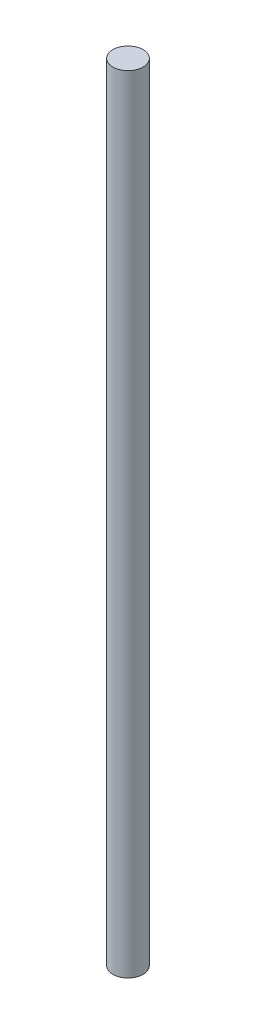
ISO-10303-21;
HEADER;
FILE_DESCRIPTION(('STEP AP214'),'2;1');
FILE_NAME('part.step','',(''),(''),'','','');
FILE_SCHEMA(('AUTOMOTIVE_DESIGN { 1 0 10303 214 1 1 1 1 }'));
ENDSEC;
DATA;
#1=APPLICATION_CONTEXT('core data for automotive mechanical design processes');
#2=APPLICATION_PROTOCOL_DEFINITION('international standard','automotive_design',2000,#1);
#3=PRODUCT_CONTEXT('',#1,'mechanical');
#4=PRODUCT('Part','Part','',(#3));
#5=PRODUCT_RELATED_PRODUCT_CATEGORY('part','',(#4));
#6=PRODUCT_DEFINITION_FORMATION('','',#4);
#7=PRODUCT_DEFINITION_CONTEXT('part definition',#1,'design');
#8=PRODUCT_DEFINITION('design','',#6,#7);
#9=PRODUCT_DEFINITION_SHAPE('','',#8);
#10=(LENGTH_UNIT() NAMED_UNIT(*) SI_UNIT(.MILLI.,.METRE.));
#11=(NAMED_UNIT(*) PLANE_ANGLE_UNIT() SI_UNIT($,.RADIAN.));
#12=(NAMED_UNIT(*) SI_UNIT($,.STERADIAN.) SOLID_ANGLE_UNIT());
#13=UNCERTAINTY_MEASURE_WITH_UNIT(LENGTH_MEASURE(1.E-05),#10,'distance_accuracy_value','');
#14=(GEOMETRIC_REPRESENTATION_CONTEXT(3) GLOBAL_UNCERTAINTY_ASSIGNED_CONTEXT((#13)) GLOBAL_UNIT_ASSIGNED_CONTEXT((#10,
#11,#12)) REPRESENTATION_CONTEXT('',''));
#15=CARTESIAN_POINT('',(0.,0.,0.));
#16=DIRECTION('',(0.,0.,1.));
#17=DIRECTION('',(1.,0.,0.));
#18=AXIS2_PLACEMENT_3D('',#15,#16,#17);
#19=CARTESIAN_POINT('',(0.,165.1,0.));
#20=DIRECTION('',(0.,-1.,0.));
#21=DIRECTION('',(0.,0.,-1.));
#22=AXIS2_PLACEMENT_3D('',#19,#20,#21);
#23=CYLINDRICAL_SURFACE('',#22,3.175);
#24=CARTESIAN_POINT('',(0.,165.1,0.));
#25=DIRECTION('',(0.,1.,0.));
#26=DIRECTION('',(0.,0.,1.));
#27=AXIS2_PLACEMENT_3D('',#24,#25,#26);
#28=CIRCLE('',#27,3.175);
#29=CARTESIAN_POINT('',(0.,165.1,3.175));
#30=VERTEX_POINT('',#29);
#31=EDGE_CURVE('E10',#30,#30,#28,.T.);
#32=ORIENTED_EDGE('',*,*,#31,.F.);
#33=EDGE_LOOP('',(#32));
#34=FACE_BOUND('',#33,.T.);
#35=CARTESIAN_POINT('',(0.,0.,0.));
#36=DIRECTION('',(0.,1.,0.));
#37=DIRECTION('',(0.,0.,1.));
#38=AXIS2_PLACEMENT_3D('',#35,#36,#37);
#39=CIRCLE('',#38,3.175);
#40=CARTESIAN_POINT('',(0.,0.,3.175));
#41=VERTEX_POINT('',#40);
#42=EDGE_CURVE('E36',#41,#41,#39,.T.);
#43=ORIENTED_EDGE('',*,*,#42,.T.);
#44=EDGE_LOOP('',(#43));
#45=FACE_BOUND('',#44,.T.);
#46=ADVANCED_FACE('F30',(#34,#45),#23,.T.);
#47=CARTESIAN_POINT('',(0.,165.1,0.));
#48=DIRECTION('',(0.,1.,0.));
#49=DIRECTION('',(0.,0.,1.));
#50=AXIS2_PLACEMENT_3D('',#47,#48,#49);
#51=PLANE('',#50);
#52=ORIENTED_EDGE('',*,*,#31,.T.);
#53=EDGE_LOOP('',(#52));
#54=FACE_BOUND('',#53,.T.);
#55=ADVANCED_FACE('F45',(#54),#51,.T.);
#56=CARTESIAN_POINT('',(0.,0.,0.));
#57=DIRECTION('',(0.,1.,0.));
#58=DIRECTION('',(0.,0.,1.));
#59=AXIS2_PLACEMENT_3D('',#56,#57,#58);
#60=PLANE('',#59);
#61=ORIENTED_EDGE('',*,*,#42,.F.);
#62=EDGE_LOOP('',(#61));
#63=FACE_BOUND('',#62,.T.);
#64=ADVANCED_FACE('F43',(#63),#60,.F.);
#65=CLOSED_SHELL('',(#46,#55,#64));
#66=MANIFOLD_SOLID_BREP('B2',#65);
#67=ADVANCED_BREP_SHAPE_REPRESENTATION('',(#18,#66),#14);
#68=SHAPE_DEFINITION_REPRESENTATION(#9,#67);
ENDSEC;
END-ISO-10303-21;
